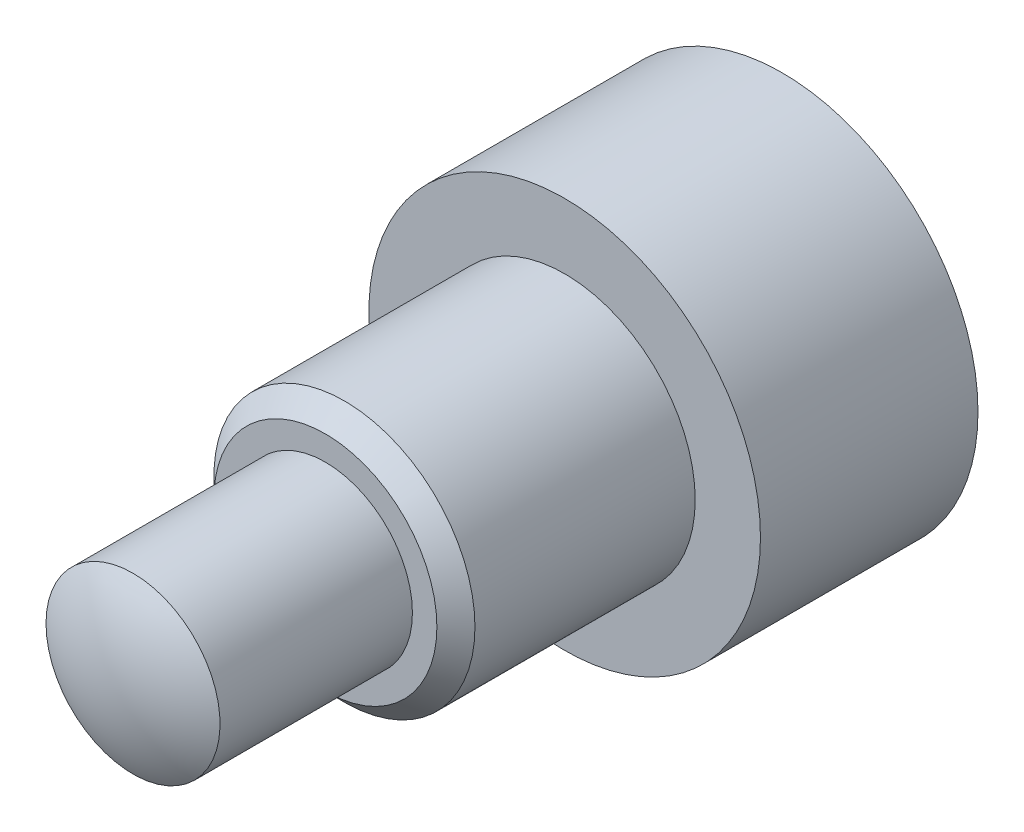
ISO-10303-21;
HEADER;
FILE_DESCRIPTION(('STEP AP214'),'2;1');
FILE_NAME('part.step','',(''),(''),'','','');
FILE_SCHEMA(('AUTOMOTIVE_DESIGN { 1 0 10303 214 1 1 1 1 }'));
ENDSEC;
DATA;
#1=APPLICATION_CONTEXT('core data for automotive mechanical design processes');
#2=APPLICATION_PROTOCOL_DEFINITION('international standard','automotive_design',2000,#1);
#3=PRODUCT_CONTEXT('',#1,'mechanical');
#4=PRODUCT('Part','Part','',(#3));
#5=PRODUCT_RELATED_PRODUCT_CATEGORY('part','',(#4));
#6=PRODUCT_DEFINITION_FORMATION('','',#4);
#7=PRODUCT_DEFINITION_CONTEXT('part definition',#1,'design');
#8=PRODUCT_DEFINITION('design','',#6,#7);
#9=PRODUCT_DEFINITION_SHAPE('','',#8);
#10=(LENGTH_UNIT() NAMED_UNIT(*) SI_UNIT(.MILLI.,.METRE.));
#11=(NAMED_UNIT(*) PLANE_ANGLE_UNIT() SI_UNIT($,.RADIAN.));
#12=(NAMED_UNIT(*) SI_UNIT($,.STERADIAN.) SOLID_ANGLE_UNIT());
#13=UNCERTAINTY_MEASURE_WITH_UNIT(LENGTH_MEASURE(1.E-05),#10,'distance_accuracy_value','');
#14=(GEOMETRIC_REPRESENTATION_CONTEXT(3) GLOBAL_UNCERTAINTY_ASSIGNED_CONTEXT((#13)) GLOBAL_UNIT_ASSIGNED_CONTEXT((#10,
#11,#12)) REPRESENTATION_CONTEXT('',''));
#15=CARTESIAN_POINT('',(0.,0.,0.));
#16=DIRECTION('',(0.,0.,1.));
#17=DIRECTION('',(1.,0.,0.));
#18=AXIS2_PLACEMENT_3D('',#15,#16,#17);
#19=CARTESIAN_POINT('',(0.,0.,21.));
#20=DIRECTION('',(0.,0.,1.));
#21=DIRECTION('',(1.,0.,0.));
#22=AXIS2_PLACEMENT_3D('',#19,#20,#21);
#23=PLANE('',#22);
#24=CARTESIAN_POINT('',(0.,0.,21.));
#25=DIRECTION('',(0.,0.,1.));
#26=DIRECTION('',(1.,0.,0.));
#27=AXIS2_PLACEMENT_3D('',#24,#25,#26);
#28=CIRCLE('',#27,5.125);
#29=CARTESIAN_POINT('',(5.125,0.,21.));
#30=VERTEX_POINT('',#29);
#31=EDGE_CURVE('E37',#30,#30,#28,.T.);
#32=ORIENTED_EDGE('',*,*,#31,.T.);
#33=EDGE_LOOP('',(#32));
#34=FACE_BOUND('',#33,.T.);
#35=CARTESIAN_POINT('',(0.,0.,21.));
#36=DIRECTION('',(0.,0.,1.));
#37=DIRECTION('',(1.,0.,0.));
#38=AXIS2_PLACEMENT_3D('',#35,#36,#37);
#39=CIRCLE('',#38,4.);
#40=CARTESIAN_POINT('',(4.,0.,21.));
#41=VERTEX_POINT('',#40);
#42=EDGE_CURVE('E49',#41,#41,#39,.T.);
#43=ORIENTED_EDGE('',*,*,#42,.F.);
#44=EDGE_LOOP('',(#43));
#45=FACE_BOUND('',#44,.T.);
#46=ADVANCED_FACE('F30',(#34,#45),#23,.T.);
#47=CARTESIAN_POINT('',(0.,0.,10.));
#48=DIRECTION('',(0.,0.,1.));
#49=DIRECTION('',(1.,0.,0.));
#50=AXIS2_PLACEMENT_3D('',#47,#48,#49);
#51=PLANE('',#50);
#52=CARTESIAN_POINT('',(0.,0.,10.));
#53=DIRECTION('',(0.,0.,1.));
#54=DIRECTION('',(1.,0.,0.));
#55=AXIS2_PLACEMENT_3D('',#52,#53,#54);
#56=CIRCLE('',#55,9.);
#57=CARTESIAN_POINT('',(9.,0.,10.));
#58=VERTEX_POINT('',#57);
#59=EDGE_CURVE('E58',#58,#58,#56,.T.);
#60=ORIENTED_EDGE('',*,*,#59,.T.);
#61=EDGE_LOOP('',(#60));
#62=FACE_BOUND('',#61,.T.);
#63=CARTESIAN_POINT('',(0.,0.,10.));
#64=DIRECTION('',(0.,0.,1.));
#65=DIRECTION('',(1.,0.,0.));
#66=AXIS2_PLACEMENT_3D('',#63,#64,#65);
#67=CIRCLE('',#66,6.);
#68=CARTESIAN_POINT('',(6.,0.,10.));
#69=VERTEX_POINT('',#68);
#70=EDGE_CURVE('E52',#69,#69,#67,.T.);
#71=ORIENTED_EDGE('',*,*,#70,.F.);
#72=EDGE_LOOP('',(#71));
#73=FACE_BOUND('',#72,.T.);
#74=ADVANCED_FACE('F71',(#62,#73),#51,.T.);
#75=CARTESIAN_POINT('',(0.,0.,10.));
#76=DIRECTION('',(0.,0.,-1.));
#77=DIRECTION('',(-1.,0.,0.));
#78=AXIS2_PLACEMENT_3D('',#75,#76,#77);
#79=CYLINDRICAL_SURFACE('',#78,9.);
#80=ORIENTED_EDGE('',*,*,#59,.F.);
#81=EDGE_LOOP('',(#80));
#82=FACE_BOUND('',#81,.T.);
#83=CARTESIAN_POINT('',(0.,0.,0.));
#84=DIRECTION('',(0.,0.,1.));
#85=DIRECTION('',(1.,0.,0.));
#86=AXIS2_PLACEMENT_3D('',#83,#84,#85);
#87=CIRCLE('',#86,9.);
#88=CARTESIAN_POINT('',(9.,0.,0.));
#89=VERTEX_POINT('',#88);
#90=EDGE_CURVE('E55',#89,#89,#87,.T.);
#91=ORIENTED_EDGE('',*,*,#90,.T.);
#92=EDGE_LOOP('',(#91));
#93=FACE_BOUND('',#92,.T.);
#94=ADVANCED_FACE('F73',(#82,#93),#79,.T.);
#95=CARTESIAN_POINT('',(0.,0.,0.));
#96=DIRECTION('',(0.,0.,1.));
#97=DIRECTION('',(1.,0.,0.));
#98=AXIS2_PLACEMENT_3D('',#95,#96,#97);
#99=PLANE('',#98);
#100=ORIENTED_EDGE('',*,*,#90,.F.);
#101=EDGE_LOOP('',(#100));
#102=FACE_BOUND('',#101,.T.);
#103=ADVANCED_FACE('F79',(#102),#99,.F.);
#104=CARTESIAN_POINT('',(0.,0.,21.));
#105=DIRECTION('',(0.,0.,-1.));
#106=DIRECTION('',(-1.,0.,0.));
#107=AXIS2_PLACEMENT_3D('',#104,#105,#106);
#108=CYLINDRICAL_SURFACE('',#107,6.);
#109=CARTESIAN_POINT('',(0.,0.,20.125));
#110=DIRECTION('',(0.,0.,1.));
#111=DIRECTION('',(1.,0.,0.));
#112=AXIS2_PLACEMENT_3D('',#109,#110,#111);
#113=CIRCLE('',#112,6.);
#114=CARTESIAN_POINT('',(6.,0.,20.125));
#115=VERTEX_POINT('',#114);
#116=EDGE_CURVE('E11',#115,#115,#113,.F.);
#117=ORIENTED_EDGE('',*,*,#116,.T.);
#118=EDGE_LOOP('',(#117));
#119=FACE_BOUND('',#118,.T.);
#120=ORIENTED_EDGE('',*,*,#70,.T.);
#121=EDGE_LOOP('',(#120));
#122=FACE_BOUND('',#121,.T.);
#123=ADVANCED_FACE('F69',(#119,#122),#108,.T.);
#124=CARTESIAN_POINT('',(0.,0.,31.));
#125=DIRECTION('',(0.,0.,-1.));
#126=DIRECTION('',(-1.,0.,0.));
#127=AXIS2_PLACEMENT_3D('',#124,#125,#126);
#128=CYLINDRICAL_SURFACE('',#127,4.);
#129=CARTESIAN_POINT('',(0.,0.,29.8442887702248));
#130=DIRECTION('',(0.,0.,-1.));
#131=DIRECTION('',(-1.,0.,0.));
#132=AXIS2_PLACEMENT_3D('',#129,#130,#131);
#133=CIRCLE('',#132,4.);
#134=CARTESIAN_POINT('',(-4.,0.,29.8442887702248));
#135=VERTEX_POINT('',#134);
#136=EDGE_CURVE('E47',#135,#135,#133,.T.);
#137=ORIENTED_EDGE('',*,*,#136,.T.);
#138=EDGE_LOOP('',(#137));
#139=FACE_BOUND('',#138,.T.);
#140=ORIENTED_EDGE('',*,*,#42,.T.);
#141=EDGE_LOOP('',(#140));
#142=FACE_BOUND('',#141,.T.);
#143=ADVANCED_FACE('F43',(#139,#142),#128,.T.);
#144=CARTESIAN_POINT('',(0.,0.,23.5));
#145=DIRECTION('',(0.,0.,-1.));
#146=DIRECTION('',(0.,1.,0.));
#147=AXIS2_PLACEMENT_3D('',#144,#145,#146);
#148=SPHERICAL_SURFACE('',#147,7.5);
#149=CARTESIAN_POINT('',(0.,0.,31.));
#150=VERTEX_POINT('',#149);
#151=VERTEX_LOOP('',#150);
#152=FACE_BOUND('',#151,.T.);
#153=ORIENTED_EDGE('',*,*,#136,.F.);
#154=EDGE_LOOP('',(#153));
#155=FACE_BOUND('',#154,.T.);
#156=ADVANCED_FACE('F40',(#152,#155),#148,.T.);
#157=CARTESIAN_POINT('',(0.,0.,21.));
#158=DIRECTION('',(0.,0.,-1.));
#159=DIRECTION('',(-1.,0.,0.));
#160=AXIS2_PLACEMENT_3D('',#157,#158,#159);
#161=CONICAL_SURFACE('',#160,5.125,0.785398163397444);
#162=ORIENTED_EDGE('',*,*,#116,.F.);
#163=EDGE_LOOP('',(#162));
#164=FACE_BOUND('',#163,.T.);
#165=ORIENTED_EDGE('',*,*,#31,.F.);
#166=EDGE_LOOP('',(#165));
#167=FACE_BOUND('',#166,.T.);
#168=ADVANCED_FACE('F32',(#164,#167),#161,.T.);
#169=CLOSED_SHELL('',(#46,#74,#94,#103,#123,#143,#156,#168));
#170=MANIFOLD_SOLID_BREP('B2',#169);
#171=ADVANCED_BREP_SHAPE_REPRESENTATION('',(#18,#170),#14);
#172=SHAPE_DEFINITION_REPRESENTATION(#9,#171);
ENDSEC;
END-ISO-10303-21;
